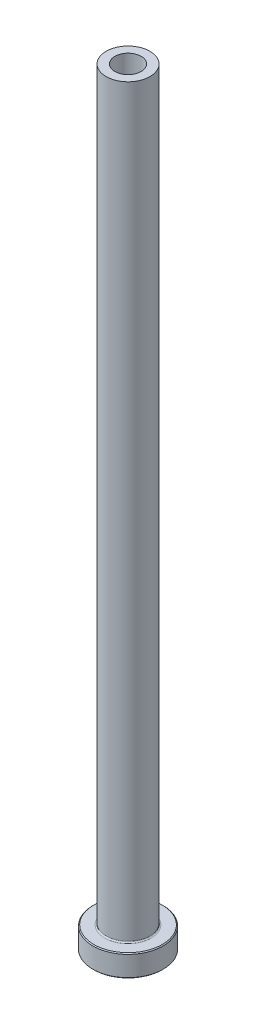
from build123d import *

# Parameters (mm, degrees)
FILLET1_R     = 0.3
CHAMFER1_SIZE = 0.2
CHAMFER3_SIZE = 0.5


with BuildPart() as part:
    # Sketch1 → Revolve1 (revolve)
    with BuildSketch(Plane.XY, mode=Mode.PRIVATE) as revolve1_sk:
        Polygon((-3, 175), (-5, 175), (-5, 5), (-8, 5), (-8, 0), (-3.25, 0), (-3.25, 118), (-3, 130), align=None)
    revolve(revolve1_sk.sketch.rotate(Axis((0, 92.187680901, 0), (0, -1, 0)), 270), axis=Axis((0, 92.187680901, 0), (0, -1, 0)))

    # Fillet1
    fillet1_edges = [part.edges().sort_by_distance(p)[0] for p in [
        (0, 5, -5),
    ]]
    fillet(fillet1_edges, radius=FILLET1_R)

    # Chamfer1
    chamfer1_edges = [part.edges().sort_by_distance(p)[0] for p in [
        (0, 0, -8),
        (0, 5, -8),
    ]]
    chamfer(chamfer1_edges, length=CHAMFER1_SIZE)

    # Chamfer3
    chamfer3_edges = [part.edges().sort_by_distance(p)[0] for p in [
        (0, 0, -3.25),
    ]]
    chamfer(chamfer3_edges, length=CHAMFER3_SIZE)


solid = part.part
